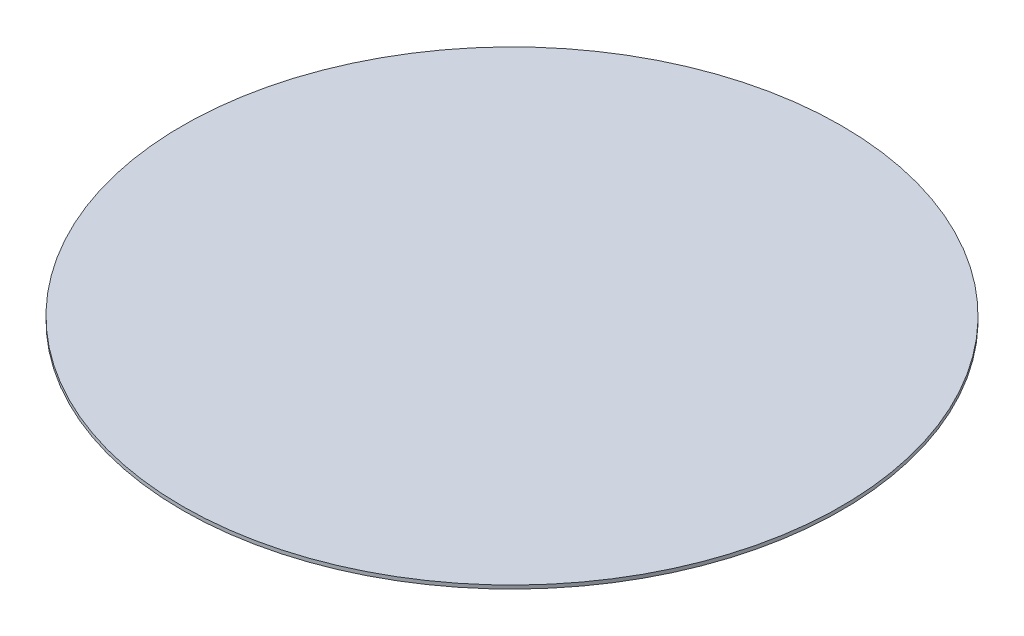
ISO-10303-21;
HEADER;
FILE_DESCRIPTION(('STEP AP214'),'2;1');
FILE_NAME('part.step','',(''),(''),'','','');
FILE_SCHEMA(('AUTOMOTIVE_DESIGN { 1 0 10303 214 1 1 1 1 }'));
ENDSEC;
DATA;
#1=APPLICATION_CONTEXT('core data for automotive mechanical design processes');
#2=APPLICATION_PROTOCOL_DEFINITION('international standard','automotive_design',2000,#1);
#3=PRODUCT_CONTEXT('',#1,'mechanical');
#4=PRODUCT('Part','Part','',(#3));
#5=PRODUCT_RELATED_PRODUCT_CATEGORY('part','',(#4));
#6=PRODUCT_DEFINITION_FORMATION('','',#4);
#7=PRODUCT_DEFINITION_CONTEXT('part definition',#1,'design');
#8=PRODUCT_DEFINITION('design','',#6,#7);
#9=PRODUCT_DEFINITION_SHAPE('','',#8);
#10=(LENGTH_UNIT() NAMED_UNIT(*) SI_UNIT(.MILLI.,.METRE.));
#11=(NAMED_UNIT(*) PLANE_ANGLE_UNIT() SI_UNIT($,.RADIAN.));
#12=(NAMED_UNIT(*) SI_UNIT($,.STERADIAN.) SOLID_ANGLE_UNIT());
#13=UNCERTAINTY_MEASURE_WITH_UNIT(LENGTH_MEASURE(1.E-05),#10,'distance_accuracy_value','');
#14=(GEOMETRIC_REPRESENTATION_CONTEXT(3) GLOBAL_UNCERTAINTY_ASSIGNED_CONTEXT((#13)) GLOBAL_UNIT_ASSIGNED_CONTEXT((#10,
#11,#12)) REPRESENTATION_CONTEXT('',''));
#15=CARTESIAN_POINT('',(0.,0.,0.));
#16=DIRECTION('',(0.,0.,1.));
#17=DIRECTION('',(1.,0.,0.));
#18=AXIS2_PLACEMENT_3D('',#15,#16,#17);
#19=CARTESIAN_POINT('',(0.,0.25,0.));
#20=DIRECTION('',(0.,-1.,0.));
#21=DIRECTION('',(0.,0.,-1.));
#22=AXIS2_PLACEMENT_3D('',#19,#20,#21);
#23=CYLINDRICAL_SURFACE('',#22,23.5);
#24=CARTESIAN_POINT('',(0.,0.25,0.));
#25=DIRECTION('',(0.,1.,0.));
#26=DIRECTION('',(0.,0.,1.));
#27=AXIS2_PLACEMENT_3D('',#24,#25,#26);
#28=CIRCLE('',#27,23.5);
#29=CARTESIAN_POINT('',(0.,0.25,23.5));
#30=VERTEX_POINT('',#29);
#31=EDGE_CURVE('E10',#30,#30,#28,.T.);
#32=ORIENTED_EDGE('',*,*,#31,.F.);
#33=EDGE_LOOP('',(#32));
#34=FACE_BOUND('',#33,.T.);
#35=CARTESIAN_POINT('',(0.,0.,0.));
#36=DIRECTION('',(0.,1.,0.));
#37=DIRECTION('',(0.,0.,1.));
#38=AXIS2_PLACEMENT_3D('',#35,#36,#37);
#39=CIRCLE('',#38,23.5);
#40=CARTESIAN_POINT('',(0.,0.,23.5));
#41=VERTEX_POINT('',#40);
#42=EDGE_CURVE('E37',#41,#41,#39,.T.);
#43=ORIENTED_EDGE('',*,*,#42,.T.);
#44=EDGE_LOOP('',(#43));
#45=FACE_BOUND('',#44,.T.);
#46=ADVANCED_FACE('F34',(#34,#45),#23,.T.);
#47=CARTESIAN_POINT('',(0.,0.25,0.));
#48=DIRECTION('',(0.,1.,0.));
#49=DIRECTION('',(0.,0.,1.));
#50=AXIS2_PLACEMENT_3D('',#47,#48,#49);
#51=PLANE('',#50);
#52=ORIENTED_EDGE('',*,*,#31,.T.);
#53=EDGE_LOOP('',(#52));
#54=FACE_BOUND('',#53,.T.);
#55=ADVANCED_FACE('F49',(#54),#51,.T.);
#56=CARTESIAN_POINT('',(0.,0.,0.));
#57=DIRECTION('',(0.,1.,0.));
#58=DIRECTION('',(0.,0.,1.));
#59=AXIS2_PLACEMENT_3D('',#56,#57,#58);
#60=PLANE('',#59);
#61=ORIENTED_EDGE('',*,*,#42,.F.);
#62=EDGE_LOOP('',(#61));
#63=FACE_BOUND('',#62,.T.);
#64=ADVANCED_FACE('F47',(#63),#60,.F.);
#65=CLOSED_SHELL('',(#46,#55,#64));
#66=MANIFOLD_SOLID_BREP('B2',#65);
#67=ADVANCED_BREP_SHAPE_REPRESENTATION('',(#18,#66),#14);
#68=SHAPE_DEFINITION_REPRESENTATION(#9,#67);
ENDSEC;
END-ISO-10303-21;
